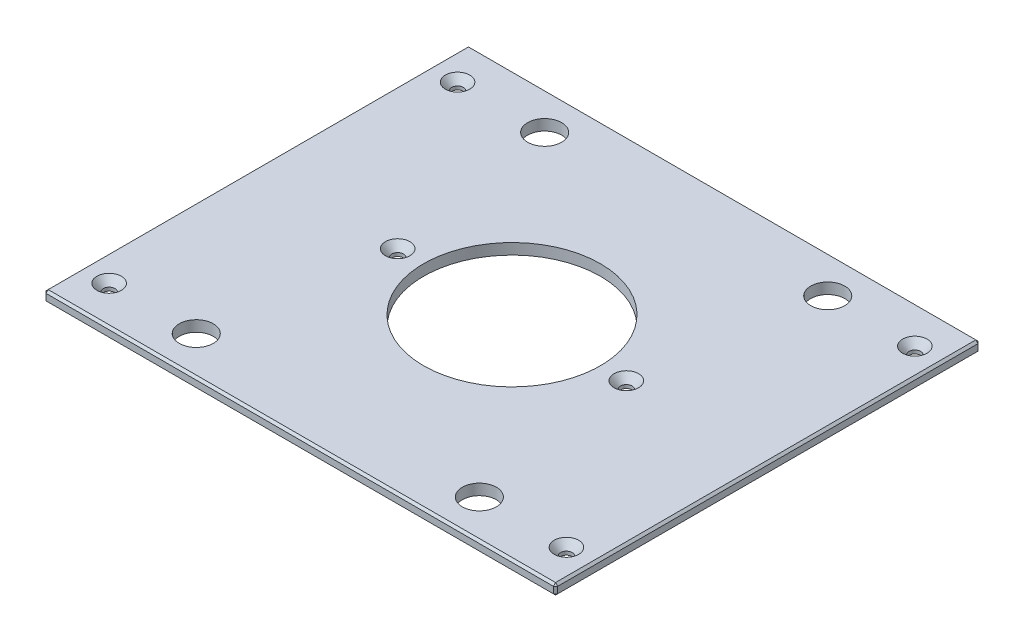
ISO-10303-21;
HEADER;
FILE_DESCRIPTION(('STEP AP214'),'2;1');
FILE_NAME('part.step','',(''),(''),'','','');
FILE_SCHEMA(('AUTOMOTIVE_DESIGN { 1 0 10303 214 1 1 1 1 }'));
ENDSEC;
DATA;
#1=APPLICATION_CONTEXT('core data for automotive mechanical design processes');
#2=APPLICATION_PROTOCOL_DEFINITION('international standard','automotive_design',2000,#1);
#3=PRODUCT_CONTEXT('',#1,'mechanical');
#4=PRODUCT('Part','Part','',(#3));
#5=PRODUCT_RELATED_PRODUCT_CATEGORY('part','',(#4));
#6=PRODUCT_DEFINITION_FORMATION('','',#4);
#7=PRODUCT_DEFINITION_CONTEXT('part definition',#1,'design');
#8=PRODUCT_DEFINITION('design','',#6,#7);
#9=PRODUCT_DEFINITION_SHAPE('','',#8);
#10=(LENGTH_UNIT() NAMED_UNIT(*) SI_UNIT(.MILLI.,.METRE.));
#11=(NAMED_UNIT(*) PLANE_ANGLE_UNIT() SI_UNIT($,.RADIAN.));
#12=(NAMED_UNIT(*) SI_UNIT($,.STERADIAN.) SOLID_ANGLE_UNIT());
#13=UNCERTAINTY_MEASURE_WITH_UNIT(LENGTH_MEASURE(1.E-05),#10,'distance_accuracy_value','');
#14=(GEOMETRIC_REPRESENTATION_CONTEXT(3) GLOBAL_UNCERTAINTY_ASSIGNED_CONTEXT((#13)) GLOBAL_UNIT_ASSIGNED_CONTEXT((#10,
#11,#12)) REPRESENTATION_CONTEXT('',''));
#15=CARTESIAN_POINT('',(0.,0.,0.));
#16=DIRECTION('',(0.,0.,1.));
#17=DIRECTION('',(1.,0.,0.));
#18=AXIS2_PLACEMENT_3D('',#15,#16,#17);
#19=CARTESIAN_POINT('',(-149.225,6.35,-123.825));
#20=DIRECTION('',(1.,0.,0.));
#21=DIRECTION('',(0.,0.,-1.));
#22=AXIS2_PLACEMENT_3D('',#19,#20,#21);
#23=PLANE('',#22);
#24=DIRECTION('',(0.,0.,-1.));
#25=VECTOR('',#24,1.);
#26=CARTESIAN_POINT('',(-149.225,5.07999999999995,-123.825));
#27=LINE('',#26,#25);
#28=CARTESIAN_POINT('',(-149.225,5.07999999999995,122.555));
#29=VERTEX_POINT('',#28);
#30=CARTESIAN_POINT('',(-149.225,5.07999999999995,-122.555));
#31=VERTEX_POINT('',#30);
#32=EDGE_CURVE('E136',#29,#31,#27,.T.);
#33=ORIENTED_EDGE('',*,*,#32,.T.);
#34=DIRECTION('',(0.,-1.,0.));
#35=VECTOR('',#34,1.);
#36=CARTESIAN_POINT('',(-149.225,6.35,-122.555));
#37=LINE('',#36,#35);
#38=CARTESIAN_POINT('',(-149.225,1.27000000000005,-122.555));
#39=VERTEX_POINT('',#38);
#40=EDGE_CURVE('E132',#31,#39,#37,.T.);
#41=ORIENTED_EDGE('',*,*,#40,.T.);
#42=DIRECTION('',(0.,0.,1.));
#43=VECTOR('',#42,1.);
#44=CARTESIAN_POINT('',(-149.225,1.27000000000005,-123.825));
#45=LINE('',#44,#43);
#46=CARTESIAN_POINT('',(-149.225,1.27000000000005,122.555));
#47=VERTEX_POINT('',#46);
#48=EDGE_CURVE('E127',#39,#47,#45,.T.);
#49=ORIENTED_EDGE('',*,*,#48,.T.);
#50=DIRECTION('',(0.,1.,0.));
#51=VECTOR('',#50,1.);
#52=CARTESIAN_POINT('',(-149.225,6.35,122.555));
#53=LINE('',#52,#51);
#54=EDGE_CURVE('E129',#47,#29,#53,.T.);
#55=ORIENTED_EDGE('',*,*,#54,.T.);
#56=EDGE_LOOP('',(#33,#41,#49,#55));
#57=FACE_BOUND('',#56,.T.);
#58=ADVANCED_FACE('F36',(#57),#23,.F.);
#59=CARTESIAN_POINT('',(-149.225,6.35,123.825));
#60=DIRECTION('',(0.,0.,-1.));
#61=DIRECTION('',(-1.,0.,0.));
#62=AXIS2_PLACEMENT_3D('',#59,#60,#61);
#63=PLANE('',#62);
#64=DIRECTION('',(1.,0.,0.));
#65=VECTOR('',#64,1.);
#66=CARTESIAN_POINT('',(-149.225,1.27000000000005,123.825));
#67=LINE('',#66,#65);
#68=CARTESIAN_POINT('',(-147.955,1.27000000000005,123.825));
#69=VERTEX_POINT('',#68);
#70=CARTESIAN_POINT('',(147.955,1.27000000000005,123.825));
#71=VERTEX_POINT('',#70);
#72=EDGE_CURVE('E59',#69,#71,#67,.T.);
#73=ORIENTED_EDGE('',*,*,#72,.T.);
#74=DIRECTION('',(0.,1.,0.));
#75=VECTOR('',#74,1.);
#76=CARTESIAN_POINT('',(147.955,6.35,123.825));
#77=LINE('',#76,#75);
#78=CARTESIAN_POINT('',(147.955,5.07999999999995,123.825));
#79=VERTEX_POINT('',#78);
#80=EDGE_CURVE('E11',#71,#79,#77,.T.);
#81=ORIENTED_EDGE('',*,*,#80,.T.);
#82=DIRECTION('',(-1.,0.,0.));
#83=VECTOR('',#82,1.);
#84=CARTESIAN_POINT('',(-149.225,5.07999999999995,123.825));
#85=LINE('',#84,#83);
#86=CARTESIAN_POINT('',(-147.955,5.07999999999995,123.825));
#87=VERTEX_POINT('',#86);
#88=EDGE_CURVE('E45',#79,#87,#85,.T.);
#89=ORIENTED_EDGE('',*,*,#88,.T.);
#90=DIRECTION('',(0.,-1.,0.));
#91=VECTOR('',#90,1.);
#92=CARTESIAN_POINT('',(-147.955,6.35,123.825));
#93=LINE('',#92,#91);
#94=EDGE_CURVE('E280',#87,#69,#93,.T.);
#95=ORIENTED_EDGE('',*,*,#94,.T.);
#96=EDGE_LOOP('',(#73,#81,#89,#95));
#97=FACE_BOUND('',#96,.T.);
#98=ADVANCED_FACE('F349',(#97),#63,.F.);
#99=CARTESIAN_POINT('',(149.225,6.35,-123.825));
#100=DIRECTION('',(-1.,0.,0.));
#101=DIRECTION('',(0.,0.,1.));
#102=AXIS2_PLACEMENT_3D('',#99,#100,#101);
#103=PLANE('',#102);
#104=DIRECTION('',(0.,0.,-1.));
#105=VECTOR('',#104,1.);
#106=CARTESIAN_POINT('',(149.225,1.27000000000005,-123.825));
#107=LINE('',#106,#105);
#108=CARTESIAN_POINT('',(149.225,1.27000000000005,122.555));
#109=VERTEX_POINT('',#108);
#110=CARTESIAN_POINT('',(149.225,1.27000000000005,-122.555));
#111=VERTEX_POINT('',#110);
#112=EDGE_CURVE('E275',#109,#111,#107,.T.);
#113=ORIENTED_EDGE('',*,*,#112,.T.);
#114=DIRECTION('',(0.,1.,0.));
#115=VECTOR('',#114,1.);
#116=CARTESIAN_POINT('',(149.225,6.35,-122.555));
#117=LINE('',#116,#115);
#118=CARTESIAN_POINT('',(149.225,5.07999999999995,-122.555));
#119=VERTEX_POINT('',#118);
#120=EDGE_CURVE('E277',#111,#119,#117,.T.);
#121=ORIENTED_EDGE('',*,*,#120,.T.);
#122=DIRECTION('',(0.,0.,1.));
#123=VECTOR('',#122,1.);
#124=CARTESIAN_POINT('',(149.225,5.07999999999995,123.825));
#125=LINE('',#124,#123);
#126=CARTESIAN_POINT('',(149.225,5.07999999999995,122.555));
#127=VERTEX_POINT('',#126);
#128=EDGE_CURVE('E273',#119,#127,#125,.T.);
#129=ORIENTED_EDGE('',*,*,#128,.T.);
#130=DIRECTION('',(0.,-1.,0.));
#131=VECTOR('',#130,1.);
#132=CARTESIAN_POINT('',(149.225,6.35,122.555));
#133=LINE('',#132,#131);
#134=EDGE_CURVE('E271',#127,#109,#133,.T.);
#135=ORIENTED_EDGE('',*,*,#134,.T.);
#136=EDGE_LOOP('',(#113,#121,#129,#135));
#137=FACE_BOUND('',#136,.T.);
#138=ADVANCED_FACE('F336',(#137),#103,.F.);
#139=CARTESIAN_POINT('',(-149.225,6.35,-123.825));
#140=DIRECTION('',(0.,0.,1.));
#141=DIRECTION('',(1.,0.,0.));
#142=AXIS2_PLACEMENT_3D('',#139,#140,#141);
#143=PLANE('',#142);
#144=DIRECTION('',(-1.,0.,0.));
#145=VECTOR('',#144,1.);
#146=CARTESIAN_POINT('',(-149.225,1.27000000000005,-123.825));
#147=LINE('',#146,#145);
#148=CARTESIAN_POINT('',(147.955,1.27000000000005,-123.825));
#149=VERTEX_POINT('',#148);
#150=CARTESIAN_POINT('',(-147.955,1.27000000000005,-123.825));
#151=VERTEX_POINT('',#150);
#152=EDGE_CURVE('E247',#149,#151,#147,.T.);
#153=ORIENTED_EDGE('',*,*,#152,.T.);
#154=DIRECTION('',(0.,1.,0.));
#155=VECTOR('',#154,1.);
#156=CARTESIAN_POINT('',(-147.955,6.35,-123.825));
#157=LINE('',#156,#155);
#158=CARTESIAN_POINT('',(-147.955,5.07999999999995,-123.825));
#159=VERTEX_POINT('',#158);
#160=EDGE_CURVE('E251',#151,#159,#157,.T.);
#161=ORIENTED_EDGE('',*,*,#160,.T.);
#162=DIRECTION('',(1.,0.,0.));
#163=VECTOR('',#162,1.);
#164=CARTESIAN_POINT('',(149.225,5.07999999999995,-123.825));
#165=LINE('',#164,#163);
#166=CARTESIAN_POINT('',(147.955,5.07999999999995,-123.825));
#167=VERTEX_POINT('',#166);
#168=EDGE_CURVE('E249',#159,#167,#165,.T.);
#169=ORIENTED_EDGE('',*,*,#168,.T.);
#170=DIRECTION('',(0.,-1.,0.));
#171=VECTOR('',#170,1.);
#172=CARTESIAN_POINT('',(147.955,6.35,-123.825));
#173=LINE('',#172,#171);
#174=EDGE_CURVE('E245',#167,#149,#173,.T.);
#175=ORIENTED_EDGE('',*,*,#174,.T.);
#176=EDGE_LOOP('',(#153,#161,#169,#175));
#177=FACE_BOUND('',#176,.T.);
#178=ADVANCED_FACE('F310',(#177),#143,.F.);
#179=CARTESIAN_POINT('',(0.,6.35,0.));
#180=DIRECTION('',(0.,1.,0.));
#181=DIRECTION('',(0.,0.,1.));
#182=AXIS2_PLACEMENT_3D('',#179,#180,#181);
#183=PLANE('',#182);
#184=CARTESIAN_POINT('',(133.35,6.35,-101.6));
#185=DIRECTION('',(0.,1.,0.));
#186=DIRECTION('',(0.,0.,1.));
#187=AXIS2_PLACEMENT_3D('',#184,#185,#186);
#188=CIRCLE('',#187,7.13739999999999);
#189=CARTESIAN_POINT('',(133.35,6.35,-94.4626));
#190=VERTEX_POINT('',#189);
#191=EDGE_CURVE('E753',#190,#190,#188,.T.);
#192=ORIENTED_EDGE('',*,*,#191,.F.);
#193=EDGE_LOOP('',(#192));
#194=FACE_BOUND('',#193,.T.);
#195=CARTESIAN_POINT('',(133.35,6.35,101.6));
#196=DIRECTION('',(0.,1.,0.));
#197=DIRECTION('',(0.,0.,1.));
#198=AXIS2_PLACEMENT_3D('',#195,#196,#197);
#199=CIRCLE('',#198,7.13739999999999);
#200=CARTESIAN_POINT('',(133.35,6.35,108.7374));
#201=VERTEX_POINT('',#200);
#202=EDGE_CURVE('E757',#201,#201,#199,.T.);
#203=ORIENTED_EDGE('',*,*,#202,.F.);
#204=EDGE_LOOP('',(#203));
#205=FACE_BOUND('',#204,.T.);
#206=CARTESIAN_POINT('',(-133.35,6.35,101.6));
#207=DIRECTION('',(0.,1.,0.));
#208=DIRECTION('',(0.,0.,1.));
#209=AXIS2_PLACEMENT_3D('',#206,#207,#208);
#210=CIRCLE('',#209,7.13739999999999);
#211=CARTESIAN_POINT('',(-133.35,6.35,108.7374));
#212=VERTEX_POINT('',#211);
#213=EDGE_CURVE('E761',#212,#212,#210,.T.);
#214=ORIENTED_EDGE('',*,*,#213,.F.);
#215=EDGE_LOOP('',(#214));
#216=FACE_BOUND('',#215,.T.);
#217=CARTESIAN_POINT('',(-66.675,6.35,0.));
#218=DIRECTION('',(0.,1.,0.));
#219=DIRECTION('',(0.,0.,1.));
#220=AXIS2_PLACEMENT_3D('',#217,#218,#219);
#221=CIRCLE('',#220,7.1374);
#222=CARTESIAN_POINT('',(-66.675,6.35,7.1374));
#223=VERTEX_POINT('',#222);
#224=EDGE_CURVE('E765',#223,#223,#221,.T.);
#225=ORIENTED_EDGE('',*,*,#224,.F.);
#226=EDGE_LOOP('',(#225));
#227=FACE_BOUND('',#226,.T.);
#228=CARTESIAN_POINT('',(66.675,6.35,0.));
#229=DIRECTION('',(0.,1.,0.));
#230=DIRECTION('',(0.,0.,1.));
#231=AXIS2_PLACEMENT_3D('',#228,#229,#230);
#232=CIRCLE('',#231,7.1374);
#233=CARTESIAN_POINT('',(66.675,6.35,7.1374));
#234=VERTEX_POINT('',#233);
#235=EDGE_CURVE('E769',#234,#234,#232,.T.);
#236=ORIENTED_EDGE('',*,*,#235,.F.);
#237=EDGE_LOOP('',(#236));
#238=FACE_BOUND('',#237,.T.);
#239=CARTESIAN_POINT('',(-133.35,6.35,-101.6));
#240=DIRECTION('',(0.,1.,0.));
#241=DIRECTION('',(0.,0.,1.));
#242=AXIS2_PLACEMENT_3D('',#239,#240,#241);
#243=CIRCLE('',#242,7.13739999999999);
#244=CARTESIAN_POINT('',(-133.35,6.35,-94.4626));
#245=VERTEX_POINT('',#244);
#246=EDGE_CURVE('E772',#245,#245,#243,.T.);
#247=ORIENTED_EDGE('',*,*,#246,.F.);
#248=EDGE_LOOP('',(#247));
#249=FACE_BOUND('',#248,.T.);
#250=DIRECTION('',(0.,0.,-1.));
#251=VECTOR('',#250,1.);
#252=CARTESIAN_POINT('',(147.955,6.35,-123.825));
#253=LINE('',#252,#251);
#254=CARTESIAN_POINT('',(147.955,6.35,122.555));
#255=VERTEX_POINT('',#254);
#256=CARTESIAN_POINT('',(147.955,6.35,-122.555));
#257=VERTEX_POINT('',#256);
#258=EDGE_CURVE('E258',#255,#257,#253,.T.);
#259=ORIENTED_EDGE('',*,*,#258,.T.);
#260=DIRECTION('',(-1.,0.,0.));
#261=VECTOR('',#260,1.);
#262=CARTESIAN_POINT('',(-149.225,6.35,-122.555));
#263=LINE('',#262,#261);
#264=CARTESIAN_POINT('',(-147.955,6.35,-122.555));
#265=VERTEX_POINT('',#264);
#266=EDGE_CURVE('E260',#257,#265,#263,.T.);
#267=ORIENTED_EDGE('',*,*,#266,.T.);
#268=DIRECTION('',(0.,0.,1.));
#269=VECTOR('',#268,1.);
#270=CARTESIAN_POINT('',(-147.955,6.35,123.825));
#271=LINE('',#270,#269);
#272=CARTESIAN_POINT('',(-147.955,6.35,122.555));
#273=VERTEX_POINT('',#272);
#274=EDGE_CURVE('E256',#265,#273,#271,.T.);
#275=ORIENTED_EDGE('',*,*,#274,.T.);
#276=DIRECTION('',(1.,0.,0.));
#277=VECTOR('',#276,1.);
#278=CARTESIAN_POINT('',(149.225,6.35,122.555));
#279=LINE('',#278,#277);
#280=EDGE_CURVE('E254',#273,#255,#279,.T.);
#281=ORIENTED_EDGE('',*,*,#280,.T.);
#282=EDGE_LOOP('',(#259,#267,#275,#281));
#283=FACE_BOUND('',#282,.T.);
#284=CARTESIAN_POINT('',(82.55,6.35,-101.6));
#285=DIRECTION('',(0.,1.,0.));
#286=DIRECTION('',(0.,0.,1.));
#287=AXIS2_PLACEMENT_3D('',#284,#285,#286);
#288=CIRCLE('',#287,9.921875);
#289=CARTESIAN_POINT('',(82.55,6.35,-91.678125));
#290=VERTEX_POINT('',#289);
#291=EDGE_CURVE('E205',#290,#290,#288,.T.);
#292=ORIENTED_EDGE('',*,*,#291,.F.);
#293=EDGE_LOOP('',(#292));
#294=FACE_BOUND('',#293,.T.);
#295=CARTESIAN_POINT('',(-82.55,6.35,-101.6));
#296=DIRECTION('',(0.,1.,0.));
#297=DIRECTION('',(0.,0.,1.));
#298=AXIS2_PLACEMENT_3D('',#295,#296,#297);
#299=CIRCLE('',#298,9.921875);
#300=CARTESIAN_POINT('',(-82.55,6.35,-91.678125));
#301=VERTEX_POINT('',#300);
#302=EDGE_CURVE('E215',#301,#301,#299,.T.);
#303=ORIENTED_EDGE('',*,*,#302,.F.);
#304=EDGE_LOOP('',(#303));
#305=FACE_BOUND('',#304,.T.);
#306=CARTESIAN_POINT('',(82.55,6.35,101.6));
#307=DIRECTION('',(0.,1.,0.));
#308=DIRECTION('',(0.,0.,1.));
#309=AXIS2_PLACEMENT_3D('',#306,#307,#308);
#310=CIRCLE('',#309,9.921875);
#311=CARTESIAN_POINT('',(82.55,6.35,111.521875));
#312=VERTEX_POINT('',#311);
#313=EDGE_CURVE('E226',#312,#312,#310,.T.);
#314=ORIENTED_EDGE('',*,*,#313,.F.);
#315=EDGE_LOOP('',(#314));
#316=FACE_BOUND('',#315,.T.);
#317=CARTESIAN_POINT('',(-82.55,6.35,101.6));
#318=DIRECTION('',(0.,1.,0.));
#319=DIRECTION('',(0.,0.,1.));
#320=AXIS2_PLACEMENT_3D('',#317,#318,#319);
#321=CIRCLE('',#320,9.921875);
#322=CARTESIAN_POINT('',(-82.55,6.35,111.521875));
#323=VERTEX_POINT('',#322);
#324=EDGE_CURVE('E232',#323,#323,#321,.T.);
#325=ORIENTED_EDGE('',*,*,#324,.F.);
#326=EDGE_LOOP('',(#325));
#327=FACE_BOUND('',#326,.T.);
#328=CARTESIAN_POINT('',(0.,6.35,0.));
#329=DIRECTION('',(0.,1.,0.));
#330=DIRECTION('',(0.,0.,1.));
#331=AXIS2_PLACEMENT_3D('',#328,#329,#330);
#332=CIRCLE('',#331,51.562);
#333=CARTESIAN_POINT('',(0.,6.35,51.562));
#334=VERTEX_POINT('',#333);
#335=EDGE_CURVE('E238',#334,#334,#332,.T.);
#336=ORIENTED_EDGE('',*,*,#335,.F.);
#337=EDGE_LOOP('',(#336));
#338=FACE_BOUND('',#337,.T.);
#339=ADVANCED_FACE('F358',(#194,#205,#216,#227,#238,#249,#283,#294,#305,#316,#327,#338),#183,.T.);
#340=CARTESIAN_POINT('',(0.,0.,0.));
#341=DIRECTION('',(0.,1.,0.));
#342=DIRECTION('',(0.,0.,1.));
#343=AXIS2_PLACEMENT_3D('',#340,#341,#342);
#344=PLANE('',#343);
#345=CARTESIAN_POINT('',(133.35,0.,-101.6));
#346=DIRECTION('',(0.,1.,0.));
#347=DIRECTION('',(0.,0.,1.));
#348=AXIS2_PLACEMENT_3D('',#345,#346,#347);
#349=CIRCLE('',#348,3.3782);
#350=CARTESIAN_POINT('',(133.35,0.,-98.2218));
#351=VERTEX_POINT('',#350);
#352=EDGE_CURVE('E806',#351,#351,#349,.T.);
#353=ORIENTED_EDGE('',*,*,#352,.T.);
#354=EDGE_LOOP('',(#353));
#355=FACE_BOUND('',#354,.T.);
#356=CARTESIAN_POINT('',(133.35,0.,101.6));
#357=DIRECTION('',(0.,1.,0.));
#358=DIRECTION('',(0.,0.,1.));
#359=AXIS2_PLACEMENT_3D('',#356,#357,#358);
#360=CIRCLE('',#359,3.3782);
#361=CARTESIAN_POINT('',(133.35,0.,104.9782));
#362=VERTEX_POINT('',#361);
#363=EDGE_CURVE('E799',#362,#362,#360,.T.);
#364=ORIENTED_EDGE('',*,*,#363,.T.);
#365=EDGE_LOOP('',(#364));
#366=FACE_BOUND('',#365,.T.);
#367=CARTESIAN_POINT('',(-133.35,0.,101.6));
#368=DIRECTION('',(0.,1.,0.));
#369=DIRECTION('',(0.,0.,1.));
#370=AXIS2_PLACEMENT_3D('',#367,#368,#369);
#371=CIRCLE('',#370,3.3782);
#372=CARTESIAN_POINT('',(-133.35,0.,104.9782));
#373=VERTEX_POINT('',#372);
#374=EDGE_CURVE('E792',#373,#373,#371,.T.);
#375=ORIENTED_EDGE('',*,*,#374,.T.);
#376=EDGE_LOOP('',(#375));
#377=FACE_BOUND('',#376,.T.);
#378=CARTESIAN_POINT('',(-66.675,0.,0.));
#379=DIRECTION('',(0.,1.,0.));
#380=DIRECTION('',(0.,0.,1.));
#381=AXIS2_PLACEMENT_3D('',#378,#379,#380);
#382=CIRCLE('',#381,3.3782);
#383=CARTESIAN_POINT('',(-66.675,0.,3.3782));
#384=VERTEX_POINT('',#383);
#385=EDGE_CURVE('E785',#384,#384,#382,.T.);
#386=ORIENTED_EDGE('',*,*,#385,.T.);
#387=EDGE_LOOP('',(#386));
#388=FACE_BOUND('',#387,.T.);
#389=CARTESIAN_POINT('',(66.675,0.,0.));
#390=DIRECTION('',(0.,1.,0.));
#391=DIRECTION('',(0.,0.,1.));
#392=AXIS2_PLACEMENT_3D('',#389,#390,#391);
#393=CIRCLE('',#392,3.3782);
#394=CARTESIAN_POINT('',(66.675,0.,3.3782));
#395=VERTEX_POINT('',#394);
#396=EDGE_CURVE('E775',#395,#395,#393,.T.);
#397=ORIENTED_EDGE('',*,*,#396,.T.);
#398=EDGE_LOOP('',(#397));
#399=FACE_BOUND('',#398,.T.);
#400=CARTESIAN_POINT('',(-133.35,0.,-101.6));
#401=DIRECTION('',(0.,1.,0.));
#402=DIRECTION('',(0.,0.,1.));
#403=AXIS2_PLACEMENT_3D('',#400,#401,#402);
#404=CIRCLE('',#403,3.3782);
#405=CARTESIAN_POINT('',(-133.35,0.,-98.2218));
#406=VERTEX_POINT('',#405);
#407=EDGE_CURVE('E218',#406,#406,#404,.T.);
#408=ORIENTED_EDGE('',*,*,#407,.T.);
#409=EDGE_LOOP('',(#408));
#410=FACE_BOUND('',#409,.T.);
#411=DIRECTION('',(0.,0.,-1.));
#412=VECTOR('',#411,1.);
#413=CARTESIAN_POINT('',(-147.955,0.,0.));
#414=LINE('',#413,#412);
#415=CARTESIAN_POINT('',(-147.955,0.,122.555));
#416=VERTEX_POINT('',#415);
#417=CARTESIAN_POINT('',(-147.955,0.,-122.555));
#418=VERTEX_POINT('',#417);
#419=EDGE_CURVE('E159',#416,#418,#414,.T.);
#420=ORIENTED_EDGE('',*,*,#419,.T.);
#421=DIRECTION('',(1.,0.,0.));
#422=VECTOR('',#421,1.);
#423=CARTESIAN_POINT('',(0.,0.,-122.555));
#424=LINE('',#423,#422);
#425=CARTESIAN_POINT('',(147.955,0.,-122.555));
#426=VERTEX_POINT('',#425);
#427=EDGE_CURVE('E268',#418,#426,#424,.T.);
#428=ORIENTED_EDGE('',*,*,#427,.T.);
#429=DIRECTION('',(0.,0.,1.));
#430=VECTOR('',#429,1.);
#431=CARTESIAN_POINT('',(147.955,0.,0.));
#432=LINE('',#431,#430);
#433=CARTESIAN_POINT('',(147.955,0.,122.555));
#434=VERTEX_POINT('',#433);
#435=EDGE_CURVE('E266',#426,#434,#432,.T.);
#436=ORIENTED_EDGE('',*,*,#435,.T.);
#437=DIRECTION('',(-1.,0.,0.));
#438=VECTOR('',#437,1.);
#439=CARTESIAN_POINT('',(0.,0.,122.555));
#440=LINE('',#439,#438);
#441=EDGE_CURVE('E263',#434,#416,#440,.T.);
#442=ORIENTED_EDGE('',*,*,#441,.T.);
#443=EDGE_LOOP('',(#420,#428,#436,#442));
#444=FACE_BOUND('',#443,.T.);
#445=CARTESIAN_POINT('',(82.55,0.,-101.6));
#446=DIRECTION('',(0.,1.,0.));
#447=DIRECTION('',(0.,0.,1.));
#448=AXIS2_PLACEMENT_3D('',#445,#446,#447);
#449=CIRCLE('',#448,9.921875);
#450=CARTESIAN_POINT('',(82.55,0.,-91.678125));
#451=VERTEX_POINT('',#450);
#452=EDGE_CURVE('E210',#451,#451,#449,.T.);
#453=ORIENTED_EDGE('',*,*,#452,.T.);
#454=EDGE_LOOP('',(#453));
#455=FACE_BOUND('',#454,.T.);
#456=CARTESIAN_POINT('',(-82.55,0.,-101.6));
#457=DIRECTION('',(0.,1.,0.));
#458=DIRECTION('',(0.,0.,1.));
#459=AXIS2_PLACEMENT_3D('',#456,#457,#458);
#460=CIRCLE('',#459,9.921875);
#461=CARTESIAN_POINT('',(-82.55,0.,-91.678125));
#462=VERTEX_POINT('',#461);
#463=EDGE_CURVE('E223',#462,#462,#460,.T.);
#464=ORIENTED_EDGE('',*,*,#463,.T.);
#465=EDGE_LOOP('',(#464));
#466=FACE_BOUND('',#465,.T.);
#467=CARTESIAN_POINT('',(82.55,0.,101.6));
#468=DIRECTION('',(0.,1.,0.));
#469=DIRECTION('',(0.,0.,1.));
#470=AXIS2_PLACEMENT_3D('',#467,#468,#469);
#471=CIRCLE('',#470,9.921875);
#472=CARTESIAN_POINT('',(82.55,0.,111.521875));
#473=VERTEX_POINT('',#472);
#474=EDGE_CURVE('E229',#473,#473,#471,.T.);
#475=ORIENTED_EDGE('',*,*,#474,.T.);
#476=EDGE_LOOP('',(#475));
#477=FACE_BOUND('',#476,.T.);
#478=CARTESIAN_POINT('',(-82.55,0.,101.6));
#479=DIRECTION('',(0.,1.,0.));
#480=DIRECTION('',(0.,0.,1.));
#481=AXIS2_PLACEMENT_3D('',#478,#479,#480);
#482=CIRCLE('',#481,9.921875);
#483=CARTESIAN_POINT('',(-82.55,0.,111.521875));
#484=VERTEX_POINT('',#483);
#485=EDGE_CURVE('E235',#484,#484,#482,.T.);
#486=ORIENTED_EDGE('',*,*,#485,.T.);
#487=EDGE_LOOP('',(#486));
#488=FACE_BOUND('',#487,.T.);
#489=CARTESIAN_POINT('',(0.,0.,0.));
#490=DIRECTION('',(0.,1.,0.));
#491=DIRECTION('',(0.,0.,1.));
#492=AXIS2_PLACEMENT_3D('',#489,#490,#491);
#493=CIRCLE('',#492,51.562);
#494=CARTESIAN_POINT('',(0.,0.,51.562));
#495=VERTEX_POINT('',#494);
#496=EDGE_CURVE('E148',#495,#495,#493,.T.);
#497=ORIENTED_EDGE('',*,*,#496,.T.);
#498=EDGE_LOOP('',(#497));
#499=FACE_BOUND('',#498,.T.);
#500=ADVANCED_FACE('F323',(#355,#366,#377,#388,#399,#410,#444,#455,#466,#477,#488,#499),#344,.F.);
#501=CARTESIAN_POINT('',(0.,0.,0.));
#502=DIRECTION('',(0.,1.,0.));
#503=DIRECTION('',(0.,0.,1.));
#504=AXIS2_PLACEMENT_3D('',#501,#502,#503);
#505=CYLINDRICAL_SURFACE('',#504,51.562);
#506=ORIENTED_EDGE('',*,*,#496,.F.);
#507=EDGE_LOOP('',(#506));
#508=FACE_BOUND('',#507,.T.);
#509=ORIENTED_EDGE('',*,*,#335,.T.);
#510=EDGE_LOOP('',(#509));
#511=FACE_BOUND('',#510,.T.);
#512=ADVANCED_FACE('F692',(#508,#511),#505,.F.);
#513=CARTESIAN_POINT('',(-82.55,6.35,101.6));
#514=DIRECTION('',(0.,1.,0.));
#515=DIRECTION('',(0.,0.,1.));
#516=AXIS2_PLACEMENT_3D('',#513,#514,#515);
#517=CYLINDRICAL_SURFACE('',#516,9.921875);
#518=ORIENTED_EDGE('',*,*,#485,.F.);
#519=EDGE_LOOP('',(#518));
#520=FACE_BOUND('',#519,.T.);
#521=ORIENTED_EDGE('',*,*,#324,.T.);
#522=EDGE_LOOP('',(#521));
#523=FACE_BOUND('',#522,.T.);
#524=ADVANCED_FACE('F683',(#520,#523),#517,.F.);
#525=CARTESIAN_POINT('',(82.55,6.35,101.6));
#526=DIRECTION('',(0.,1.,0.));
#527=DIRECTION('',(0.,0.,1.));
#528=AXIS2_PLACEMENT_3D('',#525,#526,#527);
#529=CYLINDRICAL_SURFACE('',#528,9.921875);
#530=ORIENTED_EDGE('',*,*,#474,.F.);
#531=EDGE_LOOP('',(#530));
#532=FACE_BOUND('',#531,.T.);
#533=ORIENTED_EDGE('',*,*,#313,.T.);
#534=EDGE_LOOP('',(#533));
#535=FACE_BOUND('',#534,.T.);
#536=ADVANCED_FACE('F674',(#532,#535),#529,.F.);
#537=CARTESIAN_POINT('',(-82.55,6.35,-101.6));
#538=DIRECTION('',(0.,1.,0.));
#539=DIRECTION('',(0.,0.,1.));
#540=AXIS2_PLACEMENT_3D('',#537,#538,#539);
#541=CYLINDRICAL_SURFACE('',#540,9.921875);
#542=ORIENTED_EDGE('',*,*,#463,.F.);
#543=EDGE_LOOP('',(#542));
#544=FACE_BOUND('',#543,.T.);
#545=ORIENTED_EDGE('',*,*,#302,.T.);
#546=EDGE_LOOP('',(#545));
#547=FACE_BOUND('',#546,.T.);
#548=ADVANCED_FACE('F664',(#544,#547),#541,.F.);
#549=CARTESIAN_POINT('',(82.55,6.35,-101.6));
#550=DIRECTION('',(0.,1.,0.));
#551=DIRECTION('',(0.,0.,1.));
#552=AXIS2_PLACEMENT_3D('',#549,#550,#551);
#553=CYLINDRICAL_SURFACE('',#552,9.921875);
#554=ORIENTED_EDGE('',*,*,#452,.F.);
#555=EDGE_LOOP('',(#554));
#556=FACE_BOUND('',#555,.T.);
#557=ORIENTED_EDGE('',*,*,#291,.T.);
#558=EDGE_LOOP('',(#557));
#559=FACE_BOUND('',#558,.T.);
#560=ADVANCED_FACE('F367',(#556,#559),#553,.F.);
#561=CARTESIAN_POINT('',(149.225,6.35,122.555));
#562=DIRECTION('',(-0.707106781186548,0.,-0.707106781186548));
#563=DIRECTION('',(0.,-1.,0.));
#564=AXIS2_PLACEMENT_3D('',#561,#562,#563);
#565=PLANE('',#564);
#566=DIRECTION('',(-0.707106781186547,0.,0.707106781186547));
#567=VECTOR('',#566,1.);
#568=CARTESIAN_POINT('',(149.225,5.07999999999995,122.555));
#569=LINE('',#568,#567);
#570=EDGE_CURVE('E40',#79,#127,#569,.F.);
#571=ORIENTED_EDGE('',*,*,#570,.F.);
#572=ORIENTED_EDGE('',*,*,#80,.F.);
#573=DIRECTION('',(0.707106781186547,0.,-0.707106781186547));
#574=VECTOR('',#573,1.);
#575=CARTESIAN_POINT('',(148.59,1.27000000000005,123.19));
#576=LINE('',#575,#574);
#577=EDGE_CURVE('E198',#109,#71,#576,.F.);
#578=ORIENTED_EDGE('',*,*,#577,.F.);
#579=ORIENTED_EDGE('',*,*,#134,.F.);
#580=EDGE_LOOP('',(#571,#572,#578,#579));
#581=FACE_BOUND('',#580,.T.);
#582=ADVANCED_FACE('F38',(#581),#565,.F.);
#583=CARTESIAN_POINT('',(149.225,5.07999999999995,122.555));
#584=DIRECTION('',(0.577350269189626,0.577350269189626,0.577350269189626));
#585=DIRECTION('',(0.707106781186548,0.,-0.707106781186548));
#586=AXIS2_PLACEMENT_3D('',#583,#584,#585);
#587=PLANE('',#586);
#588=DIRECTION('',(0.,-0.707106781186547,0.707106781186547));
#589=VECTOR('',#588,1.);
#590=CARTESIAN_POINT('',(147.955,5.71499999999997,123.19));
#591=LINE('',#590,#589);
#592=EDGE_CURVE('E194',#79,#255,#591,.F.);
#593=ORIENTED_EDGE('',*,*,#592,.F.);
#594=ORIENTED_EDGE('',*,*,#570,.T.);
#595=DIRECTION('',(-0.707106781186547,0.707106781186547,0.));
#596=VECTOR('',#595,1.);
#597=CARTESIAN_POINT('',(149.225,5.07999999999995,122.555));
#598=LINE('',#597,#596);
#599=EDGE_CURVE('E196',#255,#127,#598,.F.);
#600=ORIENTED_EDGE('',*,*,#599,.F.);
#601=EDGE_LOOP('',(#593,#594,#600));
#602=FACE_BOUND('',#601,.T.);
#603=ADVANCED_FACE('F360',(#602),#587,.T.);
#604=CARTESIAN_POINT('',(147.955,0.,122.555));
#605=DIRECTION('',(0.577350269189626,-0.577350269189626,0.577350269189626));
#606=DIRECTION('',(0.707106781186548,0.,-0.707106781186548));
#607=AXIS2_PLACEMENT_3D('',#604,#605,#606);
#608=PLANE('',#607);
#609=DIRECTION('',(-0.707106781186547,-0.707106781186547,0.));
#610=VECTOR('',#609,1.);
#611=CARTESIAN_POINT('',(147.955,0.,122.555));
#612=LINE('',#611,#610);
#613=EDGE_CURVE('E188',#109,#434,#612,.T.);
#614=ORIENTED_EDGE('',*,*,#613,.F.);
#615=ORIENTED_EDGE('',*,*,#577,.T.);
#616=DIRECTION('',(0.,0.707106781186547,0.707106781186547));
#617=VECTOR('',#616,1.);
#618=CARTESIAN_POINT('',(147.955,0.,122.555));
#619=LINE('',#618,#617);
#620=EDGE_CURVE('E191',#434,#71,#619,.T.);
#621=ORIENTED_EDGE('',*,*,#620,.F.);
#622=EDGE_LOOP('',(#614,#615,#621));
#623=FACE_BOUND('',#622,.T.);
#624=ADVANCED_FACE('F329',(#623),#608,.T.);
#625=CARTESIAN_POINT('',(147.955,6.35,0.));
#626=DIRECTION('',(0.707106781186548,0.707106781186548,0.));
#627=DIRECTION('',(0.,0.,1.));
#628=AXIS2_PLACEMENT_3D('',#625,#626,#627);
#629=PLANE('',#628);
#630=ORIENTED_EDGE('',*,*,#599,.T.);
#631=ORIENTED_EDGE('',*,*,#128,.F.);
#632=DIRECTION('',(0.707106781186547,-0.707106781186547,0.));
#633=VECTOR('',#632,1.);
#634=CARTESIAN_POINT('',(148.59,5.71499999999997,-122.555));
#635=LINE('',#634,#633);
#636=EDGE_CURVE('E183',#257,#119,#635,.T.);
#637=ORIENTED_EDGE('',*,*,#636,.F.);
#638=ORIENTED_EDGE('',*,*,#258,.F.);
#639=EDGE_LOOP('',(#630,#631,#637,#638));
#640=FACE_BOUND('',#639,.T.);
#641=ADVANCED_FACE('F346',(#640),#629,.T.);
#642=CARTESIAN_POINT('',(0.,6.35,122.555));
#643=DIRECTION('',(0.,0.707106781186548,0.707106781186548));
#644=DIRECTION('',(-1.,0.,0.));
#645=AXIS2_PLACEMENT_3D('',#642,#643,#644);
#646=PLANE('',#645);
#647=ORIENTED_EDGE('',*,*,#592,.T.);
#648=ORIENTED_EDGE('',*,*,#280,.F.);
#649=DIRECTION('',(0.,0.707106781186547,-0.707106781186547));
#650=VECTOR('',#649,1.);
#651=CARTESIAN_POINT('',(-147.955,6.35,122.555));
#652=LINE('',#651,#650);
#653=EDGE_CURVE('E180',#87,#273,#652,.T.);
#654=ORIENTED_EDGE('',*,*,#653,.F.);
#655=ORIENTED_EDGE('',*,*,#88,.F.);
#656=EDGE_LOOP('',(#647,#648,#654,#655));
#657=FACE_BOUND('',#656,.T.);
#658=ADVANCED_FACE('F351',(#657),#646,.T.);
#659=CARTESIAN_POINT('',(-147.955,6.35,123.825));
#660=DIRECTION('',(0.707106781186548,0.,-0.707106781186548));
#661=DIRECTION('',(0.,-1.,0.));
#662=AXIS2_PLACEMENT_3D('',#659,#660,#661);
#663=PLANE('',#662);
#664=DIRECTION('',(0.707106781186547,0.,0.707106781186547));
#665=VECTOR('',#664,1.);
#666=CARTESIAN_POINT('',(-149.225,1.27000000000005,122.555));
#667=LINE('',#666,#665);
#668=EDGE_CURVE('E143',#69,#47,#667,.F.);
#669=ORIENTED_EDGE('',*,*,#668,.F.);
#670=ORIENTED_EDGE('',*,*,#94,.F.);
#671=DIRECTION('',(-0.707106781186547,0.,-0.707106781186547));
#672=VECTOR('',#671,1.);
#673=CARTESIAN_POINT('',(-148.59,5.07999999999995,123.19));
#674=LINE('',#673,#672);
#675=EDGE_CURVE('E146',#29,#87,#674,.F.);
#676=ORIENTED_EDGE('',*,*,#675,.F.);
#677=ORIENTED_EDGE('',*,*,#54,.F.);
#678=EDGE_LOOP('',(#669,#670,#676,#677));
#679=FACE_BOUND('',#678,.T.);
#680=ADVANCED_FACE('F141',(#679),#663,.F.);
#681=CARTESIAN_POINT('',(-149.225,1.27000000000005,123.825));
#682=DIRECTION('',(0.,0.707106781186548,-0.707106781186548));
#683=DIRECTION('',(1.,0.,0.));
#684=AXIS2_PLACEMENT_3D('',#681,#682,#683);
#685=PLANE('',#684);
#686=ORIENTED_EDGE('',*,*,#620,.T.);
#687=ORIENTED_EDGE('',*,*,#72,.F.);
#688=DIRECTION('',(0.,-0.707106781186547,-0.707106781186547));
#689=VECTOR('',#688,1.);
#690=CARTESIAN_POINT('',(-147.955,0.635000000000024,123.19));
#691=LINE('',#690,#689);
#692=EDGE_CURVE('E156',#416,#69,#691,.F.);
#693=ORIENTED_EDGE('',*,*,#692,.F.);
#694=ORIENTED_EDGE('',*,*,#441,.F.);
#695=EDGE_LOOP('',(#686,#687,#693,#694));
#696=FACE_BOUND('',#695,.T.);
#697=ADVANCED_FACE('F328',(#696),#685,.F.);
#698=CARTESIAN_POINT('',(149.225,1.27000000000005,-123.825));
#699=DIRECTION('',(-0.707106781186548,0.707106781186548,0.));
#700=DIRECTION('',(0.,0.,-1.));
#701=AXIS2_PLACEMENT_3D('',#698,#699,#700);
#702=PLANE('',#701);
#703=ORIENTED_EDGE('',*,*,#613,.T.);
#704=ORIENTED_EDGE('',*,*,#435,.F.);
#705=DIRECTION('',(0.707106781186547,0.707106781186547,0.));
#706=VECTOR('',#705,1.);
#707=CARTESIAN_POINT('',(147.955,0.,-122.555));
#708=LINE('',#707,#706);
#709=EDGE_CURVE('E175',#111,#426,#708,.F.);
#710=ORIENTED_EDGE('',*,*,#709,.F.);
#711=ORIENTED_EDGE('',*,*,#112,.F.);
#712=EDGE_LOOP('',(#703,#704,#710,#711));
#713=FACE_BOUND('',#712,.T.);
#714=ADVANCED_FACE('F333',(#713),#702,.F.);
#715=CARTESIAN_POINT('',(147.955,6.35,-123.825));
#716=DIRECTION('',(-0.707106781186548,0.,0.707106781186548));
#717=DIRECTION('',(0.,-1.,0.));
#718=AXIS2_PLACEMENT_3D('',#715,#716,#717);
#719=PLANE('',#718);
#720=DIRECTION('',(0.707106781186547,0.,0.707106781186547));
#721=VECTOR('',#720,1.);
#722=CARTESIAN_POINT('',(147.955,5.07999999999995,-123.825));
#723=LINE('',#722,#721);
#724=EDGE_CURVE('E185',#119,#167,#723,.F.);
#725=ORIENTED_EDGE('',*,*,#724,.F.);
#726=ORIENTED_EDGE('',*,*,#120,.F.);
#727=DIRECTION('',(-0.707106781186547,0.,-0.707106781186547));
#728=VECTOR('',#727,1.);
#729=CARTESIAN_POINT('',(148.59,1.27000000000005,-123.19));
#730=LINE('',#729,#728);
#731=EDGE_CURVE('E172',#149,#111,#730,.F.);
#732=ORIENTED_EDGE('',*,*,#731,.F.);
#733=ORIENTED_EDGE('',*,*,#174,.F.);
#734=EDGE_LOOP('',(#725,#726,#732,#733));
#735=FACE_BOUND('',#734,.T.);
#736=ADVANCED_FACE('F341',(#735),#719,.F.);
#737=CARTESIAN_POINT('',(147.955,5.07999999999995,-123.825));
#738=DIRECTION('',(0.577350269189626,0.577350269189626,-0.577350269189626));
#739=DIRECTION('',(-0.707106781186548,0.,-0.707106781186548));
#740=AXIS2_PLACEMENT_3D('',#737,#738,#739);
#741=PLANE('',#740);
#742=ORIENTED_EDGE('',*,*,#636,.T.);
#743=ORIENTED_EDGE('',*,*,#724,.T.);
#744=DIRECTION('',(0.,0.707106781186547,0.707106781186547));
#745=VECTOR('',#744,1.);
#746=CARTESIAN_POINT('',(147.955,5.07999999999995,-123.825));
#747=LINE('',#746,#745);
#748=EDGE_CURVE('E164',#257,#167,#747,.F.);
#749=ORIENTED_EDGE('',*,*,#748,.F.);
#750=EDGE_LOOP('',(#742,#743,#749));
#751=FACE_BOUND('',#750,.T.);
#752=ADVANCED_FACE('F399',(#751),#741,.T.);
#753=CARTESIAN_POINT('',(-147.955,6.35,122.555));
#754=DIRECTION('',(-0.577350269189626,0.577350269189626,0.577350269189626));
#755=DIRECTION('',(0.707106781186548,0.,0.707106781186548));
#756=AXIS2_PLACEMENT_3D('',#753,#754,#755);
#757=PLANE('',#756);
#758=ORIENTED_EDGE('',*,*,#675,.T.);
#759=ORIENTED_EDGE('',*,*,#653,.T.);
#760=DIRECTION('',(-0.707106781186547,-0.707106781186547,0.));
#761=VECTOR('',#760,1.);
#762=CARTESIAN_POINT('',(-147.955,6.35,122.555));
#763=LINE('',#762,#761);
#764=EDGE_CURVE('E160',#29,#273,#763,.F.);
#765=ORIENTED_EDGE('',*,*,#764,.F.);
#766=EDGE_LOOP('',(#758,#759,#765));
#767=FACE_BOUND('',#766,.T.);
#768=ADVANCED_FACE('F353',(#767),#757,.T.);
#769=CARTESIAN_POINT('',(-149.225,1.27000000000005,122.555));
#770=DIRECTION('',(-0.577350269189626,-0.577350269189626,0.577350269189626));
#771=DIRECTION('',(0.707106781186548,0.,0.707106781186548));
#772=AXIS2_PLACEMENT_3D('',#769,#770,#771);
#773=PLANE('',#772);
#774=ORIENTED_EDGE('',*,*,#692,.T.);
#775=ORIENTED_EDGE('',*,*,#668,.T.);
#776=DIRECTION('',(-0.707106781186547,0.707106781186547,0.));
#777=VECTOR('',#776,1.);
#778=CARTESIAN_POINT('',(-149.225,1.27000000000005,122.555));
#779=LINE('',#778,#777);
#780=EDGE_CURVE('E153',#416,#47,#779,.T.);
#781=ORIENTED_EDGE('',*,*,#780,.F.);
#782=EDGE_LOOP('',(#774,#775,#781));
#783=FACE_BOUND('',#782,.T.);
#784=ADVANCED_FACE('F152',(#783),#773,.T.);
#785=CARTESIAN_POINT('',(147.955,0.,-122.555));
#786=DIRECTION('',(0.577350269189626,-0.577350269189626,-0.577350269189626));
#787=DIRECTION('',(-0.707106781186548,0.,-0.707106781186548));
#788=AXIS2_PLACEMENT_3D('',#785,#786,#787);
#789=PLANE('',#788);
#790=ORIENTED_EDGE('',*,*,#731,.T.);
#791=ORIENTED_EDGE('',*,*,#709,.T.);
#792=DIRECTION('',(0.,-0.707106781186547,0.707106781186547));
#793=VECTOR('',#792,1.);
#794=CARTESIAN_POINT('',(147.955,0.,-122.555));
#795=LINE('',#794,#793);
#796=EDGE_CURVE('E161',#149,#426,#795,.T.);
#797=ORIENTED_EDGE('',*,*,#796,.F.);
#798=EDGE_LOOP('',(#790,#791,#797));
#799=FACE_BOUND('',#798,.T.);
#800=ADVANCED_FACE('F391',(#799),#789,.T.);
#801=CARTESIAN_POINT('',(0.,6.35,-122.555));
#802=DIRECTION('',(0.,0.707106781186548,-0.707106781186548));
#803=DIRECTION('',(1.,0.,0.));
#804=AXIS2_PLACEMENT_3D('',#801,#802,#803);
#805=PLANE('',#804);
#806=ORIENTED_EDGE('',*,*,#748,.T.);
#807=ORIENTED_EDGE('',*,*,#168,.F.);
#808=DIRECTION('',(0.,-0.707106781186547,-0.707106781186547));
#809=VECTOR('',#808,1.);
#810=CARTESIAN_POINT('',(-147.955,5.07999999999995,-123.825));
#811=LINE('',#810,#809);
#812=EDGE_CURVE('E166',#265,#159,#811,.T.);
#813=ORIENTED_EDGE('',*,*,#812,.F.);
#814=ORIENTED_EDGE('',*,*,#266,.F.);
#815=EDGE_LOOP('',(#806,#807,#813,#814));
#816=FACE_BOUND('',#815,.T.);
#817=ADVANCED_FACE('F305',(#816),#805,.T.);
#818=CARTESIAN_POINT('',(-147.955,6.35,0.));
#819=DIRECTION('',(-0.707106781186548,0.707106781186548,0.));
#820=DIRECTION('',(0.,0.,-1.));
#821=AXIS2_PLACEMENT_3D('',#818,#819,#820);
#822=PLANE('',#821);
#823=ORIENTED_EDGE('',*,*,#764,.T.);
#824=ORIENTED_EDGE('',*,*,#274,.F.);
#825=DIRECTION('',(0.707106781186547,0.707106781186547,0.));
#826=VECTOR('',#825,1.);
#827=CARTESIAN_POINT('',(-148.59,5.71499999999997,-122.555));
#828=LINE('',#827,#826);
#829=EDGE_CURVE('E294',#31,#265,#828,.T.);
#830=ORIENTED_EDGE('',*,*,#829,.F.);
#831=ORIENTED_EDGE('',*,*,#32,.F.);
#832=EDGE_LOOP('',(#823,#824,#830,#831));
#833=FACE_BOUND('',#832,.T.);
#834=ADVANCED_FACE('F356',(#833),#822,.T.);
#835=CARTESIAN_POINT('',(-149.225,1.27000000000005,-123.825));
#836=DIRECTION('',(0.707106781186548,0.707106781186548,0.));
#837=DIRECTION('',(0.,0.,1.));
#838=AXIS2_PLACEMENT_3D('',#835,#836,#837);
#839=PLANE('',#838);
#840=ORIENTED_EDGE('',*,*,#780,.T.);
#841=ORIENTED_EDGE('',*,*,#48,.F.);
#842=DIRECTION('',(0.707106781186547,-0.707106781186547,0.));
#843=VECTOR('',#842,1.);
#844=CARTESIAN_POINT('',(-149.225,1.27000000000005,-122.555));
#845=LINE('',#844,#843);
#846=EDGE_CURVE('E291',#418,#39,#845,.F.);
#847=ORIENTED_EDGE('',*,*,#846,.F.);
#848=ORIENTED_EDGE('',*,*,#419,.F.);
#849=EDGE_LOOP('',(#840,#841,#847,#848));
#850=FACE_BOUND('',#849,.T.);
#851=ADVANCED_FACE('F158',(#850),#839,.F.);
#852=CARTESIAN_POINT('',(-149.225,1.27000000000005,-123.825));
#853=DIRECTION('',(0.,0.707106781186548,0.707106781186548));
#854=DIRECTION('',(-1.,0.,0.));
#855=AXIS2_PLACEMENT_3D('',#852,#853,#854);
#856=PLANE('',#855);
#857=ORIENTED_EDGE('',*,*,#796,.T.);
#858=ORIENTED_EDGE('',*,*,#427,.F.);
#859=DIRECTION('',(0.,0.707106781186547,-0.707106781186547));
#860=VECTOR('',#859,1.);
#861=CARTESIAN_POINT('',(-147.955,0.635000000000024,-123.19));
#862=LINE('',#861,#860);
#863=EDGE_CURVE('E288',#151,#418,#862,.F.);
#864=ORIENTED_EDGE('',*,*,#863,.F.);
#865=ORIENTED_EDGE('',*,*,#152,.F.);
#866=EDGE_LOOP('',(#857,#858,#864,#865));
#867=FACE_BOUND('',#866,.T.);
#868=ADVANCED_FACE('F320',(#867),#856,.F.);
#869=CARTESIAN_POINT('',(-147.955,5.07999999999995,-123.825));
#870=DIRECTION('',(-0.577350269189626,0.577350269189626,-0.577350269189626));
#871=DIRECTION('',(-0.707106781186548,0.,0.707106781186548));
#872=AXIS2_PLACEMENT_3D('',#869,#870,#871);
#873=PLANE('',#872);
#874=ORIENTED_EDGE('',*,*,#829,.T.);
#875=ORIENTED_EDGE('',*,*,#812,.T.);
#876=DIRECTION('',(0.707106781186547,0.,-0.707106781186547));
#877=VECTOR('',#876,1.);
#878=CARTESIAN_POINT('',(-147.955,5.07999999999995,-123.825));
#879=LINE('',#878,#877);
#880=EDGE_CURVE('E286',#31,#159,#879,.T.);
#881=ORIENTED_EDGE('',*,*,#880,.F.);
#882=EDGE_LOOP('',(#874,#875,#881));
#883=FACE_BOUND('',#882,.T.);
#884=ADVANCED_FACE('F300',(#883),#873,.T.);
#885=CARTESIAN_POINT('',(-149.225,1.27000000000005,-122.555));
#886=DIRECTION('',(-0.577350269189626,-0.577350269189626,-0.577350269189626));
#887=DIRECTION('',(-0.707106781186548,0.,0.707106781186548));
#888=AXIS2_PLACEMENT_3D('',#885,#886,#887);
#889=PLANE('',#888);
#890=ORIENTED_EDGE('',*,*,#863,.T.);
#891=ORIENTED_EDGE('',*,*,#846,.T.);
#892=DIRECTION('',(-0.707106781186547,0.,0.707106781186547));
#893=VECTOR('',#892,1.);
#894=CARTESIAN_POINT('',(-149.225,1.27000000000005,-122.555));
#895=LINE('',#894,#893);
#896=EDGE_CURVE('E284',#151,#39,#895,.T.);
#897=ORIENTED_EDGE('',*,*,#896,.F.);
#898=EDGE_LOOP('',(#890,#891,#897));
#899=FACE_BOUND('',#898,.T.);
#900=ADVANCED_FACE('F317',(#899),#889,.T.);
#901=CARTESIAN_POINT('',(-149.225,6.35,-122.555));
#902=DIRECTION('',(0.707106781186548,0.,0.707106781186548));
#903=DIRECTION('',(0.,-1.,0.));
#904=AXIS2_PLACEMENT_3D('',#901,#902,#903);
#905=PLANE('',#904);
#906=ORIENTED_EDGE('',*,*,#880,.T.);
#907=ORIENTED_EDGE('',*,*,#160,.F.);
#908=ORIENTED_EDGE('',*,*,#896,.T.);
#909=ORIENTED_EDGE('',*,*,#40,.F.);
#910=EDGE_LOOP('',(#906,#907,#908,#909));
#911=FACE_BOUND('',#910,.T.);
#912=ADVANCED_FACE('F315',(#911),#905,.F.);
#913=CARTESIAN_POINT('',(-133.35,6.35,-101.6));
#914=DIRECTION('',(0.,1.,0.));
#915=DIRECTION('',(0.,0.,1.));
#916=AXIS2_PLACEMENT_3D('',#913,#914,#915);
#917=CYLINDRICAL_SURFACE('',#916,3.3782);
#918=ORIENTED_EDGE('',*,*,#407,.F.);
#919=EDGE_LOOP('',(#918));
#920=FACE_BOUND('',#919,.T.);
#921=CARTESIAN_POINT('',(-133.35,2.02553508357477,-101.6));
#922=DIRECTION('',(0.,1.,0.));
#923=DIRECTION('',(0.,0.,1.));
#924=AXIS2_PLACEMENT_3D('',#921,#922,#923);
#925=CIRCLE('',#924,3.3782);
#926=CARTESIAN_POINT('',(-133.35,2.02553508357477,-98.2218));
#927=VERTEX_POINT('',#926);
#928=EDGE_CURVE('E774',#927,#927,#925,.T.);
#929=ORIENTED_EDGE('',*,*,#928,.T.);
#930=EDGE_LOOP('',(#929));
#931=FACE_BOUND('',#930,.T.);
#932=ADVANCED_FACE('F378',(#920,#931),#917,.F.);
#933=CARTESIAN_POINT('',(-133.35,6.35,-101.6));
#934=DIRECTION('',(0.,1.,0.));
#935=DIRECTION('',(0.,0.,1.));
#936=AXIS2_PLACEMENT_3D('',#933,#934,#935);
#937=CONICAL_SURFACE('',#936,7.13739999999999,0.715584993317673);
#938=ORIENTED_EDGE('',*,*,#928,.F.);
#939=EDGE_LOOP('',(#938));
#940=FACE_BOUND('',#939,.T.);
#941=ORIENTED_EDGE('',*,*,#246,.T.);
#942=EDGE_LOOP('',(#941));
#943=FACE_BOUND('',#942,.T.);
#944=ADVANCED_FACE('F488',(#940,#943),#937,.F.);
#945=CARTESIAN_POINT('',(66.675,6.35,0.));
#946=DIRECTION('',(0.,1.,0.));
#947=DIRECTION('',(0.,0.,1.));
#948=AXIS2_PLACEMENT_3D('',#945,#946,#947);
#949=CYLINDRICAL_SURFACE('',#948,3.3782);
#950=ORIENTED_EDGE('',*,*,#396,.F.);
#951=EDGE_LOOP('',(#950));
#952=FACE_BOUND('',#951,.T.);
#953=CARTESIAN_POINT('',(66.675,2.02553508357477,0.));
#954=DIRECTION('',(0.,1.,0.));
#955=DIRECTION('',(0.,0.,1.));
#956=AXIS2_PLACEMENT_3D('',#953,#954,#955);
#957=CIRCLE('',#956,3.3782);
#958=CARTESIAN_POINT('',(66.675,2.02553508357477,3.3782));
#959=VERTEX_POINT('',#958);
#960=EDGE_CURVE('E779',#959,#959,#957,.T.);
#961=ORIENTED_EDGE('',*,*,#960,.T.);
#962=EDGE_LOOP('',(#961));
#963=FACE_BOUND('',#962,.T.);
#964=ADVANCED_FACE('F497',(#952,#963),#949,.F.);
#965=CARTESIAN_POINT('',(66.675,6.35,0.));
#966=DIRECTION('',(0.,1.,0.));
#967=DIRECTION('',(0.,0.,1.));
#968=AXIS2_PLACEMENT_3D('',#965,#966,#967);
#969=CONICAL_SURFACE('',#968,7.1374,0.715584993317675);
#970=ORIENTED_EDGE('',*,*,#960,.F.);
#971=EDGE_LOOP('',(#970));
#972=FACE_BOUND('',#971,.T.);
#973=ORIENTED_EDGE('',*,*,#235,.T.);
#974=EDGE_LOOP('',(#973));
#975=FACE_BOUND('',#974,.T.);
#976=ADVANCED_FACE('F505',(#972,#975),#969,.F.);
#977=CARTESIAN_POINT('',(-66.675,6.35,0.));
#978=DIRECTION('',(0.,1.,0.));
#979=DIRECTION('',(0.,0.,1.));
#980=AXIS2_PLACEMENT_3D('',#977,#978,#979);
#981=CYLINDRICAL_SURFACE('',#980,3.3782);
#982=ORIENTED_EDGE('',*,*,#385,.F.);
#983=EDGE_LOOP('',(#982));
#984=FACE_BOUND('',#983,.T.);
#985=CARTESIAN_POINT('',(-66.675,2.02553508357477,0.));
#986=DIRECTION('',(0.,1.,0.));
#987=DIRECTION('',(0.,0.,1.));
#988=AXIS2_PLACEMENT_3D('',#985,#986,#987);
#989=CIRCLE('',#988,3.3782);
#990=CARTESIAN_POINT('',(-66.675,2.02553508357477,3.3782));
#991=VERTEX_POINT('',#990);
#992=EDGE_CURVE('E788',#991,#991,#989,.T.);
#993=ORIENTED_EDGE('',*,*,#992,.T.);
#994=EDGE_LOOP('',(#993));
#995=FACE_BOUND('',#994,.T.);
#996=ADVANCED_FACE('F513',(#984,#995),#981,.F.);
#997=CARTESIAN_POINT('',(-66.675,6.35,0.));
#998=DIRECTION('',(0.,1.,0.));
#999=DIRECTION('',(0.,0.,1.));
#1000=AXIS2_PLACEMENT_3D('',#997,#998,#999);
#1001=CONICAL_SURFACE('',#1000,7.1374,0.715584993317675);
#1002=ORIENTED_EDGE('',*,*,#992,.F.);
#1003=EDGE_LOOP('',(#1002));
#1004=FACE_BOUND('',#1003,.T.);
#1005=ORIENTED_EDGE('',*,*,#224,.T.);
#1006=EDGE_LOOP('',(#1005));
#1007=FACE_BOUND('',#1006,.T.);
#1008=ADVANCED_FACE('F521',(#1004,#1007),#1001,.F.);
#1009=CARTESIAN_POINT('',(-133.35,6.35,101.6));
#1010=DIRECTION('',(0.,1.,0.));
#1011=DIRECTION('',(0.,0.,1.));
#1012=AXIS2_PLACEMENT_3D('',#1009,#1010,#1011);
#1013=CYLINDRICAL_SURFACE('',#1012,3.3782);
#1014=ORIENTED_EDGE('',*,*,#374,.F.);
#1015=EDGE_LOOP('',(#1014));
#1016=FACE_BOUND('',#1015,.T.);
#1017=CARTESIAN_POINT('',(-133.35,2.02553508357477,101.6));
#1018=DIRECTION('',(0.,1.,0.));
#1019=DIRECTION('',(0.,0.,1.));
#1020=AXIS2_PLACEMENT_3D('',#1017,#1018,#1019);
#1021=CIRCLE('',#1020,3.3782);
#1022=CARTESIAN_POINT('',(-133.35,2.02553508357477,104.9782));
#1023=VERTEX_POINT('',#1022);
#1024=EDGE_CURVE('E795',#1023,#1023,#1021,.T.);
#1025=ORIENTED_EDGE('',*,*,#1024,.T.);
#1026=EDGE_LOOP('',(#1025));
#1027=FACE_BOUND('',#1026,.T.);
#1028=ADVANCED_FACE('F529',(#1016,#1027),#1013,.F.);
#1029=CARTESIAN_POINT('',(-133.35,6.35,101.6));
#1030=DIRECTION('',(0.,1.,0.));
#1031=DIRECTION('',(0.,0.,1.));
#1032=AXIS2_PLACEMENT_3D('',#1029,#1030,#1031);
#1033=CONICAL_SURFACE('',#1032,7.13739999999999,0.715584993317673);
#1034=ORIENTED_EDGE('',*,*,#1024,.F.);
#1035=EDGE_LOOP('',(#1034));
#1036=FACE_BOUND('',#1035,.T.);
#1037=ORIENTED_EDGE('',*,*,#213,.T.);
#1038=EDGE_LOOP('',(#1037));
#1039=FACE_BOUND('',#1038,.T.);
#1040=ADVANCED_FACE('F537',(#1036,#1039),#1033,.F.);
#1041=CARTESIAN_POINT('',(133.35,6.35,101.6));
#1042=DIRECTION('',(0.,1.,0.));
#1043=DIRECTION('',(0.,0.,1.));
#1044=AXIS2_PLACEMENT_3D('',#1041,#1042,#1043);
#1045=CYLINDRICAL_SURFACE('',#1044,3.3782);
#1046=ORIENTED_EDGE('',*,*,#363,.F.);
#1047=EDGE_LOOP('',(#1046));
#1048=FACE_BOUND('',#1047,.T.);
#1049=CARTESIAN_POINT('',(133.35,2.02553508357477,101.6));
#1050=DIRECTION('',(0.,1.,0.));
#1051=DIRECTION('',(0.,0.,1.));
#1052=AXIS2_PLACEMENT_3D('',#1049,#1050,#1051);
#1053=CIRCLE('',#1052,3.3782);
#1054=CARTESIAN_POINT('',(133.35,2.02553508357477,104.9782));
#1055=VERTEX_POINT('',#1054);
#1056=EDGE_CURVE('E802',#1055,#1055,#1053,.T.);
#1057=ORIENTED_EDGE('',*,*,#1056,.T.);
#1058=EDGE_LOOP('',(#1057));
#1059=FACE_BOUND('',#1058,.T.);
#1060=ADVANCED_FACE('F545',(#1048,#1059),#1045,.F.);
#1061=CARTESIAN_POINT('',(133.35,6.35,101.6));
#1062=DIRECTION('',(0.,1.,0.));
#1063=DIRECTION('',(0.,0.,1.));
#1064=AXIS2_PLACEMENT_3D('',#1061,#1062,#1063);
#1065=CONICAL_SURFACE('',#1064,7.13739999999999,0.715584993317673);
#1066=ORIENTED_EDGE('',*,*,#1056,.F.);
#1067=EDGE_LOOP('',(#1066));
#1068=FACE_BOUND('',#1067,.T.);
#1069=ORIENTED_EDGE('',*,*,#202,.T.);
#1070=EDGE_LOOP('',(#1069));
#1071=FACE_BOUND('',#1070,.T.);
#1072=ADVANCED_FACE('F553',(#1068,#1071),#1065,.F.);
#1073=CARTESIAN_POINT('',(133.35,6.35,-101.6));
#1074=DIRECTION('',(0.,1.,0.));
#1075=DIRECTION('',(0.,0.,1.));
#1076=AXIS2_PLACEMENT_3D('',#1073,#1074,#1075);
#1077=CYLINDRICAL_SURFACE('',#1076,3.3782);
#1078=ORIENTED_EDGE('',*,*,#352,.F.);
#1079=EDGE_LOOP('',(#1078));
#1080=FACE_BOUND('',#1079,.T.);
#1081=CARTESIAN_POINT('',(133.35,2.02553508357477,-101.6));
#1082=DIRECTION('',(0.,1.,0.));
#1083=DIRECTION('',(0.,0.,1.));
#1084=AXIS2_PLACEMENT_3D('',#1081,#1082,#1083);
#1085=CIRCLE('',#1084,3.3782);
#1086=CARTESIAN_POINT('',(133.35,2.02553508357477,-98.2218));
#1087=VERTEX_POINT('',#1086);
#1088=EDGE_CURVE('E809',#1087,#1087,#1085,.T.);
#1089=ORIENTED_EDGE('',*,*,#1088,.T.);
#1090=EDGE_LOOP('',(#1089));
#1091=FACE_BOUND('',#1090,.T.);
#1092=ADVANCED_FACE('F561',(#1080,#1091),#1077,.F.);
#1093=CARTESIAN_POINT('',(133.35,6.35,-101.6));
#1094=DIRECTION('',(0.,1.,0.));
#1095=DIRECTION('',(0.,0.,1.));
#1096=AXIS2_PLACEMENT_3D('',#1093,#1094,#1095);
#1097=CONICAL_SURFACE('',#1096,7.13739999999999,0.715584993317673);
#1098=ORIENTED_EDGE('',*,*,#1088,.F.);
#1099=EDGE_LOOP('',(#1098));
#1100=FACE_BOUND('',#1099,.T.);
#1101=ORIENTED_EDGE('',*,*,#191,.T.);
#1102=EDGE_LOOP('',(#1101));
#1103=FACE_BOUND('',#1102,.T.);
#1104=ADVANCED_FACE('F569',(#1100,#1103),#1097,.F.);
#1105=CLOSED_SHELL('',(#58,#98,#138,#178,#339,#500,#512,#524,#536,#548,#560,#582,#603,#624,#641,
#658,#680,#697,#714,#736,#752,#768,#784,#800,#817,#834,#851,#868,#884,#900,#912,#932,#944,#964,
#976,#996,#1008,#1028,#1040,#1060,#1072,#1092,#1104));
#1106=MANIFOLD_SOLID_BREP('B2',#1105);
#1107=ADVANCED_BREP_SHAPE_REPRESENTATION('',(#18,#1106),#14);
#1108=SHAPE_DEFINITION_REPRESENTATION(#9,#1107);
ENDSEC;
END-ISO-10303-21;
